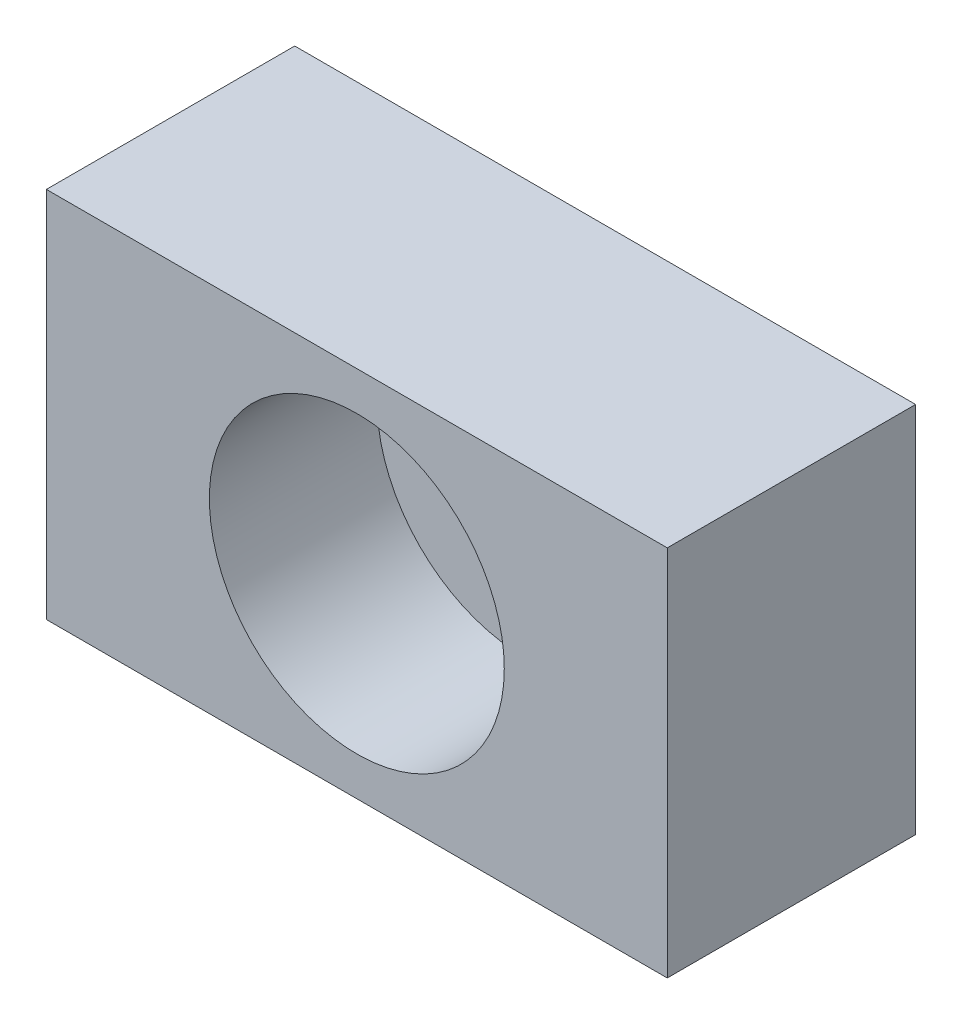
ISO-10303-21;
HEADER;
FILE_DESCRIPTION(('STEP AP214'),'2;1');
FILE_NAME('part.step','',(''),(''),'','','');
FILE_SCHEMA(('AUTOMOTIVE_DESIGN { 1 0 10303 214 1 1 1 1 }'));
ENDSEC;
DATA;
#1=APPLICATION_CONTEXT('core data for automotive mechanical design processes');
#2=APPLICATION_PROTOCOL_DEFINITION('international standard','automotive_design',2000,#1);
#3=PRODUCT_CONTEXT('',#1,'mechanical');
#4=PRODUCT('Part','Part','',(#3));
#5=PRODUCT_RELATED_PRODUCT_CATEGORY('part','',(#4));
#6=PRODUCT_DEFINITION_FORMATION('','',#4);
#7=PRODUCT_DEFINITION_CONTEXT('part definition',#1,'design');
#8=PRODUCT_DEFINITION('design','',#6,#7);
#9=PRODUCT_DEFINITION_SHAPE('','',#8);
#10=(LENGTH_UNIT() NAMED_UNIT(*) SI_UNIT(.MILLI.,.METRE.));
#11=(NAMED_UNIT(*) PLANE_ANGLE_UNIT() SI_UNIT($,.RADIAN.));
#12=(NAMED_UNIT(*) SI_UNIT($,.STERADIAN.) SOLID_ANGLE_UNIT());
#13=UNCERTAINTY_MEASURE_WITH_UNIT(LENGTH_MEASURE(1.E-05),#10,'distance_accuracy_value','');
#14=(GEOMETRIC_REPRESENTATION_CONTEXT(3) GLOBAL_UNCERTAINTY_ASSIGNED_CONTEXT((#13)) GLOBAL_UNIT_ASSIGNED_CONTEXT((#10,
#11,#12)) REPRESENTATION_CONTEXT('',''));
#15=CARTESIAN_POINT('',(0.,0.,0.));
#16=DIRECTION('',(0.,0.,1.));
#17=DIRECTION('',(1.,0.,0.));
#18=AXIS2_PLACEMENT_3D('',#15,#16,#17);
#19=CARTESIAN_POINT('',(-10.,-6.,8.));
#20=DIRECTION('',(0.,0.,-1.));
#21=DIRECTION('',(-1.,0.,0.));
#22=AXIS2_PLACEMENT_3D('',#19,#20,#21);
#23=PLANE('',#22);
#24=DIRECTION('',(1.,0.,0.));
#25=VECTOR('',#24,1.);
#26=CARTESIAN_POINT('',(-10.,-6.,8.));
#27=LINE('',#26,#25);
#28=CARTESIAN_POINT('',(-10.,-6.,8.));
#29=VERTEX_POINT('',#28);
#30=CARTESIAN_POINT('',(10.,-6.,8.));
#31=VERTEX_POINT('',#30);
#32=EDGE_CURVE('E85',#29,#31,#27,.T.);
#33=ORIENTED_EDGE('',*,*,#32,.T.);
#34=DIRECTION('',(0.,1.,0.));
#35=VECTOR('',#34,1.);
#36=CARTESIAN_POINT('',(10.,-6.,8.));
#37=LINE('',#36,#35);
#38=CARTESIAN_POINT('',(10.,6.,8.));
#39=VERTEX_POINT('',#38);
#40=EDGE_CURVE('E61',#31,#39,#37,.T.);
#41=ORIENTED_EDGE('',*,*,#40,.T.);
#42=DIRECTION('',(-1.,0.,0.));
#43=VECTOR('',#42,1.);
#44=CARTESIAN_POINT('',(10.,6.,8.));
#45=LINE('',#44,#43);
#46=CARTESIAN_POINT('',(-10.,6.,8.));
#47=VERTEX_POINT('',#46);
#48=EDGE_CURVE('E82',#39,#47,#45,.T.);
#49=ORIENTED_EDGE('',*,*,#48,.T.);
#50=DIRECTION('',(0.,-1.,0.));
#51=VECTOR('',#50,1.);
#52=CARTESIAN_POINT('',(-10.,6.,8.));
#53=LINE('',#52,#51);
#54=EDGE_CURVE('E79',#47,#29,#53,.T.);
#55=ORIENTED_EDGE('',*,*,#54,.T.);
#56=EDGE_LOOP('',(#33,#41,#49,#55));
#57=FACE_BOUND('',#56,.T.);
#58=CARTESIAN_POINT('',(0.,0.,8.));
#59=DIRECTION('',(0.,0.,1.));
#60=DIRECTION('',(1.,0.,0.));
#61=AXIS2_PLACEMENT_3D('',#58,#59,#60);
#62=CIRCLE('',#61,4.75);
#63=CARTESIAN_POINT('',(4.75,0.,8.));
#64=VERTEX_POINT('',#63);
#65=EDGE_CURVE('E69',#64,#64,#62,.T.);
#66=ORIENTED_EDGE('',*,*,#65,.F.);
#67=EDGE_LOOP('',(#66));
#68=FACE_BOUND('',#67,.T.);
#69=ADVANCED_FACE('F14',(#57,#68),#23,.F.);
#70=CARTESIAN_POINT('',(-10.,-6.,0.));
#71=DIRECTION('',(0.,0.,-1.));
#72=DIRECTION('',(-1.,0.,0.));
#73=AXIS2_PLACEMENT_3D('',#70,#71,#72);
#74=PLANE('',#73);
#75=DIRECTION('',(1.,0.,0.));
#76=VECTOR('',#75,1.);
#77=CARTESIAN_POINT('',(-10.,-6.,0.));
#78=LINE('',#77,#76);
#79=CARTESIAN_POINT('',(-10.,-6.,0.));
#80=VERTEX_POINT('',#79);
#81=CARTESIAN_POINT('',(10.,-6.,0.));
#82=VERTEX_POINT('',#81);
#83=EDGE_CURVE('E65',#80,#82,#78,.T.);
#84=ORIENTED_EDGE('',*,*,#83,.F.);
#85=DIRECTION('',(0.,-1.,0.));
#86=VECTOR('',#85,1.);
#87=CARTESIAN_POINT('',(-10.,6.,0.));
#88=LINE('',#87,#86);
#89=CARTESIAN_POINT('',(-10.,6.,0.));
#90=VERTEX_POINT('',#89);
#91=EDGE_CURVE('E75',#90,#80,#88,.T.);
#92=ORIENTED_EDGE('',*,*,#91,.F.);
#93=DIRECTION('',(-1.,0.,0.));
#94=VECTOR('',#93,1.);
#95=CARTESIAN_POINT('',(10.,6.,0.));
#96=LINE('',#95,#94);
#97=CARTESIAN_POINT('',(10.,6.,0.));
#98=VERTEX_POINT('',#97);
#99=EDGE_CURVE('E73',#98,#90,#96,.T.);
#100=ORIENTED_EDGE('',*,*,#99,.F.);
#101=DIRECTION('',(0.,1.,0.));
#102=VECTOR('',#101,1.);
#103=CARTESIAN_POINT('',(10.,-6.,0.));
#104=LINE('',#103,#102);
#105=EDGE_CURVE('E58',#82,#98,#104,.T.);
#106=ORIENTED_EDGE('',*,*,#105,.F.);
#107=EDGE_LOOP('',(#84,#92,#100,#106));
#108=FACE_BOUND('',#107,.T.);
#109=CARTESIAN_POINT('',(0.,0.,0.));
#110=DIRECTION('',(0.,0.,1.));
#111=DIRECTION('',(1.,0.,0.));
#112=AXIS2_PLACEMENT_3D('',#109,#110,#111);
#113=CIRCLE('',#112,2.75);
#114=CARTESIAN_POINT('',(2.75,0.,0.));
#115=VERTEX_POINT('',#114);
#116=EDGE_CURVE('E101',#115,#115,#113,.T.);
#117=ORIENTED_EDGE('',*,*,#116,.T.);
#118=EDGE_LOOP('',(#117));
#119=FACE_BOUND('',#118,.T.);
#120=ADVANCED_FACE('F71',(#108,#119),#74,.T.);
#121=CARTESIAN_POINT('',(-10.,-6.,8.));
#122=DIRECTION('',(0.,1.,0.));
#123=DIRECTION('',(0.,0.,1.));
#124=AXIS2_PLACEMENT_3D('',#121,#122,#123);
#125=PLANE('',#124);
#126=DIRECTION('',(0.,0.,-1.));
#127=VECTOR('',#126,1.);
#128=CARTESIAN_POINT('',(10.,-6.,8.));
#129=LINE('',#128,#127);
#130=EDGE_CURVE('E9',#31,#82,#129,.T.);
#131=ORIENTED_EDGE('',*,*,#130,.F.);
#132=ORIENTED_EDGE('',*,*,#32,.F.);
#133=DIRECTION('',(0.,0.,-1.));
#134=VECTOR('',#133,1.);
#135=CARTESIAN_POINT('',(-10.,-6.,8.));
#136=LINE('',#135,#134);
#137=EDGE_CURVE('E29',#29,#80,#136,.T.);
#138=ORIENTED_EDGE('',*,*,#137,.T.);
#139=ORIENTED_EDGE('',*,*,#83,.T.);
#140=EDGE_LOOP('',(#131,#132,#138,#139));
#141=FACE_BOUND('',#140,.T.);
#142=ADVANCED_FACE('F66',(#141),#125,.F.);
#143=CARTESIAN_POINT('',(10.,-6.,8.));
#144=DIRECTION('',(-1.,0.,0.));
#145=DIRECTION('',(0.,-1.,0.));
#146=AXIS2_PLACEMENT_3D('',#143,#144,#145);
#147=PLANE('',#146);
#148=DIRECTION('',(0.,0.,-1.));
#149=VECTOR('',#148,1.);
#150=CARTESIAN_POINT('',(10.,6.,8.));
#151=LINE('',#150,#149);
#152=EDGE_CURVE('E22',#39,#98,#151,.T.);
#153=ORIENTED_EDGE('',*,*,#152,.F.);
#154=ORIENTED_EDGE('',*,*,#40,.F.);
#155=ORIENTED_EDGE('',*,*,#130,.T.);
#156=ORIENTED_EDGE('',*,*,#105,.T.);
#157=EDGE_LOOP('',(#153,#154,#155,#156));
#158=FACE_BOUND('',#157,.T.);
#159=ADVANCED_FACE('F16',(#158),#147,.F.);
#160=CARTESIAN_POINT('',(10.,6.,8.));
#161=DIRECTION('',(0.,-1.,0.));
#162=DIRECTION('',(1.,0.,0.));
#163=AXIS2_PLACEMENT_3D('',#160,#161,#162);
#164=PLANE('',#163);
#165=DIRECTION('',(0.,0.,-1.));
#166=VECTOR('',#165,1.);
#167=CARTESIAN_POINT('',(-10.,6.,8.));
#168=LINE('',#167,#166);
#169=EDGE_CURVE('E37',#47,#90,#168,.T.);
#170=ORIENTED_EDGE('',*,*,#169,.F.);
#171=ORIENTED_EDGE('',*,*,#48,.F.);
#172=ORIENTED_EDGE('',*,*,#152,.T.);
#173=ORIENTED_EDGE('',*,*,#99,.T.);
#174=EDGE_LOOP('',(#170,#171,#172,#173));
#175=FACE_BOUND('',#174,.T.);
#176=ADVANCED_FACE('F88',(#175),#164,.F.);
#177=CARTESIAN_POINT('',(-10.,6.,8.));
#178=DIRECTION('',(1.,0.,0.));
#179=DIRECTION('',(0.,1.,0.));
#180=AXIS2_PLACEMENT_3D('',#177,#178,#179);
#181=PLANE('',#180);
#182=ORIENTED_EDGE('',*,*,#54,.F.);
#183=ORIENTED_EDGE('',*,*,#169,.T.);
#184=ORIENTED_EDGE('',*,*,#91,.T.);
#185=ORIENTED_EDGE('',*,*,#137,.F.);
#186=EDGE_LOOP('',(#182,#183,#184,#185));
#187=FACE_BOUND('',#186,.T.);
#188=ADVANCED_FACE('F91',(#187),#181,.F.);
#189=CARTESIAN_POINT('',(0.,0.,8.));
#190=DIRECTION('',(0.,0.,1.));
#191=DIRECTION('',(1.,0.,0.));
#192=AXIS2_PLACEMENT_3D('',#189,#190,#191);
#193=CYLINDRICAL_SURFACE('',#192,4.75);
#194=ORIENTED_EDGE('',*,*,#65,.T.);
#195=EDGE_LOOP('',(#194));
#196=FACE_BOUND('',#195,.T.);
#197=CARTESIAN_POINT('',(0.,0.,2.6));
#198=DIRECTION('',(0.,0.,1.));
#199=DIRECTION('',(1.,0.,0.));
#200=AXIS2_PLACEMENT_3D('',#197,#198,#199);
#201=CIRCLE('',#200,4.75);
#202=CARTESIAN_POINT('',(4.75,0.,2.6));
#203=VERTEX_POINT('',#202);
#204=EDGE_CURVE('E95',#203,#203,#201,.T.);
#205=ORIENTED_EDGE('',*,*,#204,.F.);
#206=EDGE_LOOP('',(#205));
#207=FACE_BOUND('',#206,.T.);
#208=ADVANCED_FACE('F114',(#196,#207),#193,.F.);
#209=CARTESIAN_POINT('',(2.75,0.,2.6));
#210=DIRECTION('',(0.,0.,1.));
#211=DIRECTION('',(1.,0.,0.));
#212=AXIS2_PLACEMENT_3D('',#209,#210,#211);
#213=PLANE('',#212);
#214=ORIENTED_EDGE('',*,*,#204,.T.);
#215=EDGE_LOOP('',(#214));
#216=FACE_BOUND('',#215,.T.);
#217=CARTESIAN_POINT('',(0.,0.,2.6));
#218=DIRECTION('',(0.,0.,1.));
#219=DIRECTION('',(1.,0.,0.));
#220=AXIS2_PLACEMENT_3D('',#217,#218,#219);
#221=CIRCLE('',#220,2.75);
#222=CARTESIAN_POINT('',(2.75,0.,2.6));
#223=VERTEX_POINT('',#222);
#224=EDGE_CURVE('E98',#223,#223,#221,.T.);
#225=ORIENTED_EDGE('',*,*,#224,.F.);
#226=EDGE_LOOP('',(#225));
#227=FACE_BOUND('',#226,.T.);
#228=ADVANCED_FACE('F107',(#216,#227),#213,.T.);
#229=CARTESIAN_POINT('',(0.,0.,8.));
#230=DIRECTION('',(0.,0.,1.));
#231=DIRECTION('',(1.,0.,0.));
#232=AXIS2_PLACEMENT_3D('',#229,#230,#231);
#233=CYLINDRICAL_SURFACE('',#232,2.75);
#234=ORIENTED_EDGE('',*,*,#224,.T.);
#235=EDGE_LOOP('',(#234));
#236=FACE_BOUND('',#235,.T.);
#237=ORIENTED_EDGE('',*,*,#116,.F.);
#238=EDGE_LOOP('',(#237));
#239=FACE_BOUND('',#238,.T.);
#240=ADVANCED_FACE('F105',(#236,#239),#233,.F.);
#241=CLOSED_SHELL('',(#69,#120,#142,#159,#176,#188,#208,#228,#240));
#242=MANIFOLD_SOLID_BREP('B1',#241);
#243=ADVANCED_BREP_SHAPE_REPRESENTATION('',(#18,#242),#14);
#244=SHAPE_DEFINITION_REPRESENTATION(#9,#243);
ENDSEC;
END-ISO-10303-21;
